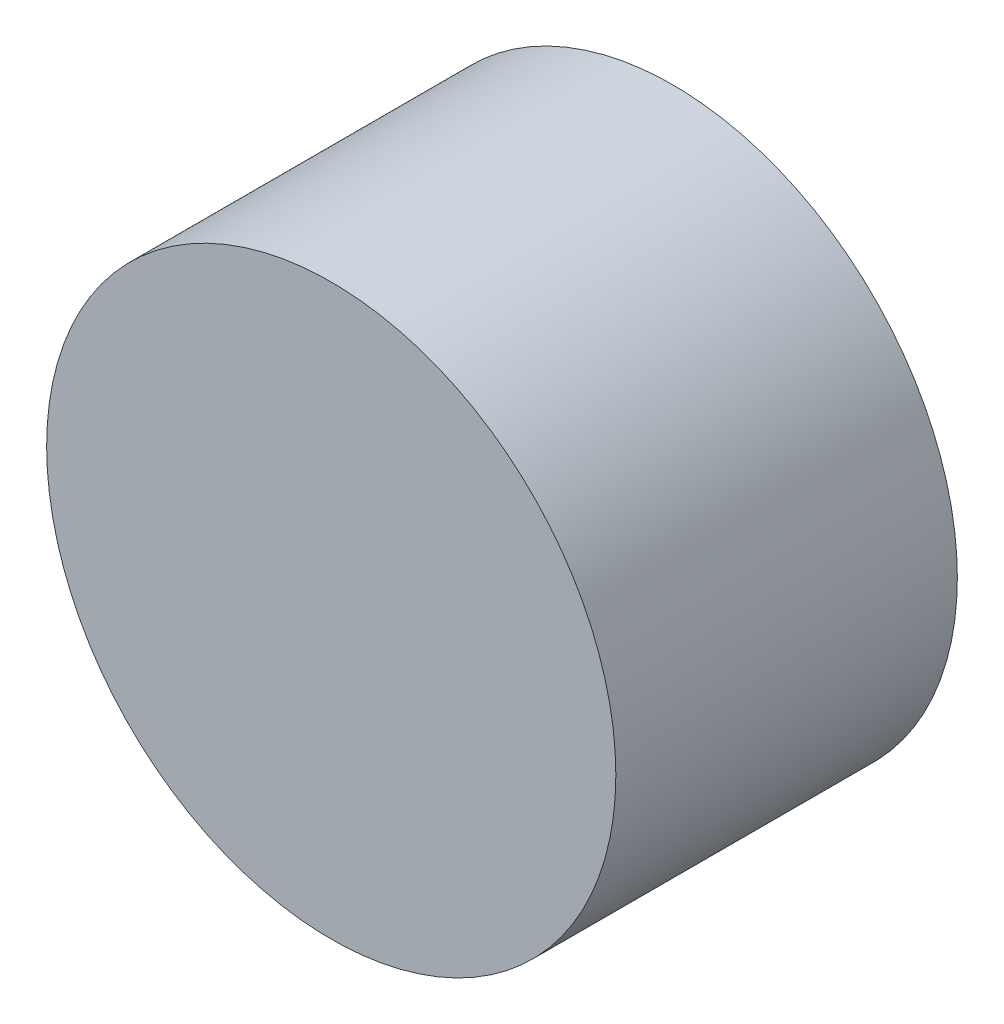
from build123d import *

# Parameters (mm, degrees)
ESQUISSE1_R        = 2.5
BOSS_EXTRU_1_DEPTH = 3


with BuildPart() as part:
    # Esquisse1 → Boss.-Extru.1 (new body)
    with BuildSketch(Plane.XY):
        Circle(ESQUISSE1_R)
    extrude(amount=BOSS_EXTRU_1_DEPTH)


solid = part.part
